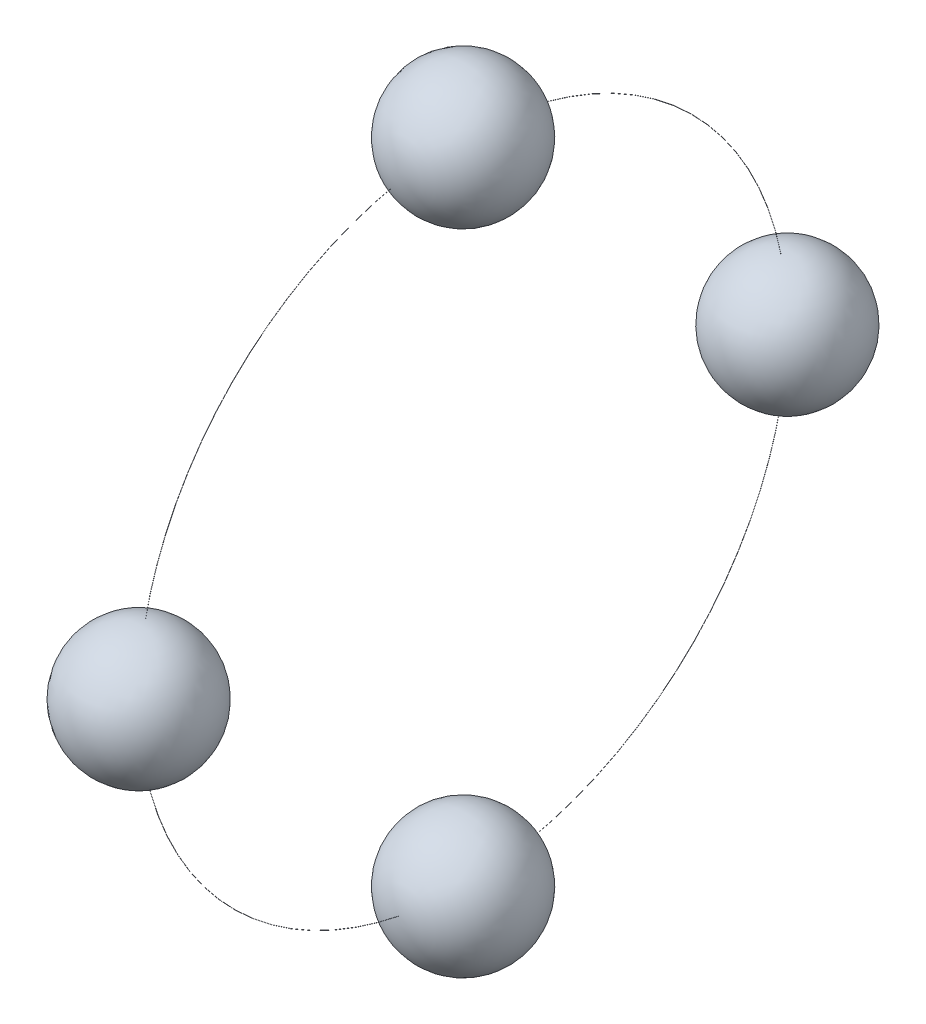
ISO-10303-21;
HEADER;
FILE_DESCRIPTION(('STEP AP214'),'2;1');
FILE_NAME('part.step','',(''),(''),'','','');
FILE_SCHEMA(('AUTOMOTIVE_DESIGN { 1 0 10303 214 1 1 1 1 }'));
ENDSEC;
DATA;
#1=APPLICATION_CONTEXT('core data for automotive mechanical design processes');
#2=APPLICATION_PROTOCOL_DEFINITION('international standard','automotive_design',2000,#1);
#3=PRODUCT_CONTEXT('',#1,'mechanical');
#4=PRODUCT('Part','Part','',(#3));
#5=PRODUCT_RELATED_PRODUCT_CATEGORY('part','',(#4));
#6=PRODUCT_DEFINITION_FORMATION('','',#4);
#7=PRODUCT_DEFINITION_CONTEXT('part definition',#1,'design');
#8=PRODUCT_DEFINITION('design','',#6,#7);
#9=PRODUCT_DEFINITION_SHAPE('','',#8);
#10=(LENGTH_UNIT() NAMED_UNIT(*) SI_UNIT(.MILLI.,.METRE.));
#11=(NAMED_UNIT(*) PLANE_ANGLE_UNIT() SI_UNIT($,.RADIAN.));
#12=(NAMED_UNIT(*) SI_UNIT($,.STERADIAN.) SOLID_ANGLE_UNIT());
#13=UNCERTAINTY_MEASURE_WITH_UNIT(LENGTH_MEASURE(1.E-05),#10,'distance_accuracy_value','');
#14=(GEOMETRIC_REPRESENTATION_CONTEXT(3) GLOBAL_UNCERTAINTY_ASSIGNED_CONTEXT((#13)) GLOBAL_UNIT_ASSIGNED_CONTEXT((#10,
#11,#12)) REPRESENTATION_CONTEXT('',''));
#15=CARTESIAN_POINT('',(0.,0.,0.));
#16=DIRECTION('',(0.,0.,1.));
#17=DIRECTION('',(1.,0.,0.));
#18=AXIS2_PLACEMENT_3D('',#15,#16,#17);
#19=CARTESIAN_POINT('',(3.,0.,0.));
#20=DIRECTION('',(1.,0.,0.));
#21=DIRECTION('',(0.,-1.,0.));
#22=AXIS2_PLACEMENT_3D('',#19,#20,#21);
#23=TOROIDAL_SURFACE('',#22,8.,0.002);
#24=CARTESIAN_POINT('',(2.99941404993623,-1.59217084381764,-7.84191249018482));
#25=CARTESIAN_POINT('',(2.99930675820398,-1.59216753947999,-7.84187960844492));
#26=CARTESIAN_POINT('',(2.9992021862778,-1.59216332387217,-7.84183765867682));
#27=CARTESIAN_POINT('',(2.99900153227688,-1.59215319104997,-7.84173682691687));
#28=CARTESIAN_POINT('',(2.99890546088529,-1.59214727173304,-7.84167792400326));
#29=CARTESIAN_POINT('',(2.99872466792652,-1.59213390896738,-7.84154495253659));
#30=CARTESIAN_POINT('',(2.9986399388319,-1.59212646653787,-7.84147089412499));
#31=CARTESIAN_POINT('',(2.99848415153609,-1.59211027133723,-7.84130973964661));
#32=CARTESIAN_POINT('',(2.99841309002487,-1.5921015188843,-7.84122264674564));
#33=CARTESIAN_POINT('',(2.99828634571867,-1.59208291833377,-7.84103756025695));
#34=CARTESIAN_POINT('',(2.99823071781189,-1.59207306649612,-7.84093952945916));
#35=CARTESIAN_POINT('',(2.99813670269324,-1.59205257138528,-7.84073559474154));
#36=CARTESIAN_POINT('',(2.99809831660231,-1.59204192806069,-7.84062969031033));
#37=CARTESIAN_POINT('',(2.99803970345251,-1.59202009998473,-7.84041249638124));
#38=CARTESIAN_POINT('',(2.99801956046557,-1.59200891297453,-7.84030118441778));
#39=CARTESIAN_POINT('',(2.99799828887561,-1.59198635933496,-7.84007677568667));
#40=CARTESIAN_POINT('',(2.99799716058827,-1.5919749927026,-7.83996367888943));
#41=CARTESIAN_POINT('',(2.99801397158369,-1.59195237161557,-7.83973860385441));
#42=CARTESIAN_POINT('',(2.9980319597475,-1.59194111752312,-7.83962662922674));
#43=CARTESIAN_POINT('',(2.99808658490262,-1.59191907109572,-7.83940727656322));
#44=CARTESIAN_POINT('',(2.99812322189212,-1.59190827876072,-7.83929989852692));
#45=CARTESIAN_POINT('',(2.99821410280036,-1.59188747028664,-7.83909286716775));
#46=CARTESIAN_POINT('',(2.99826833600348,-1.59187745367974,-7.83899320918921));
#47=CARTESIAN_POINT('',(2.99839290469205,-1.5918584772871,-7.83880440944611));
#48=CARTESIAN_POINT('',(2.9984632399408,-1.59184951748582,-7.83871526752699));
#49=CARTESIAN_POINT('',(2.9986177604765,-1.5918329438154,-7.83855037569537));
#50=CARTESIAN_POINT('',(2.99870189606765,-1.59182532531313,-7.83847457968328));
#51=CARTESIAN_POINT('',(2.99888181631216,-1.59181161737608,-7.83833820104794));
#52=CARTESIAN_POINT('',(2.99897760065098,-1.59180552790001,-7.83827761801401));
#53=CARTESIAN_POINT('',(2.99917759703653,-1.59179508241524,-7.8381736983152));
#54=CARTESIAN_POINT('',(2.99928176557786,-1.59179071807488,-7.83813027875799));
#55=CARTESIAN_POINT('',(2.99949596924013,-1.59178380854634,-7.83806153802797));
#56=CARTESIAN_POINT('',(2.99960600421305,-1.59178126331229,-7.83803621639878));
#57=CARTESIAN_POINT('',(2.99982833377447,-1.59177807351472,-7.83800448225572));
#58=CARTESIAN_POINT('',(2.9999406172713,-1.59177742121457,-7.83799799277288));
#59=CARTESIAN_POINT('',(3.00016468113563,-1.59177801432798,-7.83800389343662));
#60=CARTESIAN_POINT('',(3.00027646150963,-1.59177925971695,-7.83801628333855));
#61=CARTESIAN_POINT('',(3.0004961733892,-1.59178360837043,-7.83805954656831));
#62=CARTESIAN_POINT('',(3.00060411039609,-1.59178670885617,-7.83809039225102));
#63=CARTESIAN_POINT('',(3.00081326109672,-1.59179467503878,-7.83816964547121));
#64=CARTESIAN_POINT('',(3.00091447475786,-1.5917995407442,-7.83821805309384));
#65=CARTESIAN_POINT('',(3.00110750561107,-1.59181090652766,-7.83833112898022));
#66=CARTESIAN_POINT('',(3.00119930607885,-1.59181740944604,-7.83839582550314));
#67=CARTESIAN_POINT('',(3.00137074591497,-1.59183185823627,-7.83853957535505));
#68=CARTESIAN_POINT('',(3.00145038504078,-1.59183980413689,-7.83861862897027));
#69=CARTESIAN_POINT('',(3.00159560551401,-1.59185694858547,-7.83878920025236));
#70=CARTESIAN_POINT('',(3.00166112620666,-1.59186615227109,-7.83888076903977));
#71=CARTESIAN_POINT('',(3.0017758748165,-1.59188552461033,-7.83907350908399));
#72=CARTESIAN_POINT('',(3.00182510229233,-1.59189569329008,-7.83917468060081));
#73=CARTESIAN_POINT('',(3.00190611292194,-1.59191675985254,-7.83938428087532));
#74=CARTESIAN_POINT('',(3.00193781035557,-1.59192766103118,-7.83949274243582));
#75=CARTESIAN_POINT('',(3.00198252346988,-1.59194983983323,-7.83971341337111));
#76=CARTESIAN_POINT('',(3.00199553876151,-1.59196111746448,-7.83982562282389));
#77=CARTESIAN_POINT('',(3.00200254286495,-1.59198376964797,-7.84005100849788));
#78=CARTESIAN_POINT('',(3.00199646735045,-1.59199514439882,-7.8401641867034));
#79=CARTESIAN_POINT('',(3.00196531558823,-1.59201763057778,-7.84038792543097));
#80=CARTESIAN_POINT('',(3.0019402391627,-1.59202874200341,-7.84049848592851));
#81=CARTESIAN_POINT('',(3.00187176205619,-1.59205039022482,-7.84071389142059));
#82=CARTESIAN_POINT('',(3.00182835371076,-1.59206092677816,-7.84081873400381));
#83=CARTESIAN_POINT('',(3.00172441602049,-1.59208111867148,-7.84101965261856));
#84=CARTESIAN_POINT('',(3.00166388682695,-1.59209077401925,-7.84111572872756));
#85=CARTESIAN_POINT('',(3.00152758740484,-1.59210890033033,-7.84129609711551));
#86=CARTESIAN_POINT('',(3.00145185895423,-1.5921173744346,-7.84138042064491));
#87=CARTESIAN_POINT('',(3.00128719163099,-1.59213292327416,-7.84153514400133));
#88=CARTESIAN_POINT('',(3.00119825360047,-1.59213999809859,-7.84160554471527));
#89=CARTESIAN_POINT('',(3.00101014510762,-1.59215251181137,-7.84173006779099));
#90=CARTESIAN_POINT('',(3.0009110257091,-1.59215795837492,-7.84178426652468));
#91=CARTESIAN_POINT('',(3.00070498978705,-1.59216710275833,-7.84187526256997));
#92=CARTESIAN_POINT('',(3.00059807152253,-1.59217080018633,-7.84191205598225));
#93=CARTESIAN_POINT('',(3.00037998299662,-1.59217632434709,-7.84196702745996));
#94=CARTESIAN_POINT('',(3.00026883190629,-1.59217815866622,-7.84198528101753));
#95=CARTESIAN_POINT('',(3.00004512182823,-1.5921799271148,-7.84200287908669));
#96=CARTESIAN_POINT('',(2.99993256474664,-1.59217986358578,-7.84200224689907));
#97=CARTESIAN_POINT('',(2.99975196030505,-1.59217823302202,-7.8419860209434));
#98=CARTESIAN_POINT('',(2.99968333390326,-1.59217724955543,-7.84197623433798));
#99=CARTESIAN_POINT('',(2.99954747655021,-1.59217457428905,-7.84194961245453));
#100=CARTESIAN_POINT('',(2.99948024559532,-1.59217288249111,-7.84193277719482));
#101=CARTESIAN_POINT('',(2.99941404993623,-1.59217084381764,-7.84191249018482));
#102=B_SPLINE_CURVE_WITH_KNOTS('',3,(#24,#25,#26,#27,#28,#29,#30,#31,#32,#33,#34,#35,#36,#37,
#38,#39,#40,#41,#42,#43,#44,#45,#46,#47,#48,#49,#50,#51,#52,#53,#54,#55,#56,#57,#58,#59,#60,#61,
#62,#63,#64,#65,#66,#67,#68,#69,#70,#71,#72,#73,#74,#75,#76,#77,#78,#79,#80,#81,#82,#83,#84,#85,
#86,#87,#88,#89,#90,#91,#92,#93,#94,#95,#96,#97,#98,#99,#100,#101),.UNSPECIFIED.,.T.,.F.,(4,2,2,
2,2,2,2,2,2,2,2,2,2,2,2,2,2,2,2,2,2,2,2,2,2,2,2,2,2,2,2,2,2,2,2,2,2,2,4),(0.,
0.000336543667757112,0.000673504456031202,0.00101024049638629,0.0013468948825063,
0.00168473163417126,0.00202259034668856,0.0023619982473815,0.0027014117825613,
0.00304169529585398,0.00338197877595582,0.00372205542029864,0.00406212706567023,
0.00440099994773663,0.00473986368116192,0.00507707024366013,0.00541426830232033,
0.00575008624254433,0.00608589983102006,0.00642121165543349,0.00675652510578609,
0.00709242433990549,0.00742833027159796,0.00776565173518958,0.00810298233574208,
0.00844194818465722,0.00878092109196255,0.00912103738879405,0.00946115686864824,
0.00980141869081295,0.0101416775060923,0.0104810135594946,0.0108203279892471,0.0111580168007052,
0.0114957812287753,0.011832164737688,0.0121681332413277,0.012375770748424,0.0125834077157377),.UNSPECIFIED.);
#103=CARTESIAN_POINT('',(2.99941404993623,-1.59217084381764,-7.84191249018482));
#104=VERTEX_POINT('',#103);
#105=EDGE_CURVE('E10',#104,#104,#102,.T.);
#106=ORIENTED_EDGE('',*,*,#105,.F.);
#107=EDGE_LOOP('',(#106));
#108=FACE_BOUND('',#107,.T.);
#109=CARTESIAN_POINT('',(2.99941404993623,-7.84191249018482,-1.59217084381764));
#110=CARTESIAN_POINT('',(2.99952091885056,-7.84194523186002,-1.59217413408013));
#111=CARTESIAN_POINT('',(2.99963064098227,-7.84196902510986,-1.59217652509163));
#112=CARTESIAN_POINT('',(2.99985263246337,-7.84199795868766,-1.59217943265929));
#113=CARTESIAN_POINT('',(2.99996490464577,-7.84200307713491,-1.59217994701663));
#114=CARTESIAN_POINT('',(3.00018867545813,-7.84199447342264,-1.59217908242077));
#115=CARTESIAN_POINT('',(3.00030017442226,-7.84198075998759,-1.5921777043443));
#116=CARTESIAN_POINT('',(3.00051924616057,-7.84193490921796,-1.59217309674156));
#117=CARTESIAN_POINT('',(3.00062681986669,-7.84190277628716,-1.59216986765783));
#118=CARTESIAN_POINT('',(3.00083507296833,-7.84182101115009,-1.59216165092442));
#119=CARTESIAN_POINT('',(3.00093574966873,-7.84177137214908,-1.59215666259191));
#120=CARTESIAN_POINT('',(3.00112733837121,-7.84165603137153,-1.59214507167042));
#121=CARTESIAN_POINT('',(3.00121824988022,-7.84159032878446,-1.59213846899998));
#122=CARTESIAN_POINT('',(3.00138804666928,-7.84144451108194,-1.59212381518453));
#123=CARTESIAN_POINT('',(3.00146689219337,-7.84136435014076,-1.59211575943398));
#124=CARTESIAN_POINT('',(3.0016100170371,-7.84119205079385,-1.59209844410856));
#125=CARTESIAN_POINT('',(3.00167429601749,-7.84109991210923,-1.59208918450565));
#126=CARTESIAN_POINT('',(3.00178679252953,-7.84090579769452,-1.59206967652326));
#127=CARTESIAN_POINT('',(3.00183493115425,-7.84080377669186,-1.59205942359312));
#128=CARTESIAN_POINT('',(3.00191339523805,-7.84059316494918,-1.59203825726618));
#129=CARTESIAN_POINT('',(3.00194372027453,-7.84048457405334,-1.59202734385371));
#130=CARTESIAN_POINT('',(3.0019858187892,-7.8402634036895,-1.59200511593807));
#131=CARTESIAN_POINT('',(3.00199751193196,-7.84015080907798,-1.59199379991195));
#132=CARTESIAN_POINT('',(3.00200177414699,-7.83992526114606,-1.59197113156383));
#133=CARTESIAN_POINT('',(3.00199434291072,-7.83981230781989,-1.59195977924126));
#134=CARTESIAN_POINT('',(3.00196052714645,-7.83958902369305,-1.59193733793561));
#135=CARTESIAN_POINT('',(3.00193410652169,-7.83947869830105,-1.59192624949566));
#136=CARTESIAN_POINT('',(3.00186300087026,-7.839264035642,-1.59190467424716));
#137=CARTESIAN_POINT('',(3.00181831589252,-7.83915969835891,-1.59189418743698));
#138=CARTESIAN_POINT('',(3.00171199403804,-7.83896013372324,-1.59187412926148));
#139=CARTESIAN_POINT('',(3.00165037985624,-7.83886489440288,-1.59186455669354));
#140=CARTESIAN_POINT('',(3.00151189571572,-7.83868611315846,-1.59184658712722));
#141=CARTESIAN_POINT('',(3.001435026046,-7.83860257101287,-1.59183819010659));
#142=CARTESIAN_POINT('',(3.00126853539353,-7.83844992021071,-1.59182284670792));
#143=CARTESIAN_POINT('',(3.00117896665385,-7.83838075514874,-1.59181589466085));
#144=CARTESIAN_POINT('',(3.0009893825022,-7.83825845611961,-1.59180360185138));
#145=CARTESIAN_POINT('',(3.0008893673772,-7.83820532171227,-1.59179826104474));
#146=CARTESIAN_POINT('',(3.00068225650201,-7.83811686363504,-1.59178936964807));
#147=CARTESIAN_POINT('',(3.00057519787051,-7.83808145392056,-1.59178581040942));
#148=CARTESIAN_POINT('',(3.00035661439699,-7.83802909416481,-1.59178054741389));
#149=CARTESIAN_POINT('',(3.00024508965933,-7.8380121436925,-1.59177884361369));
#150=CARTESIAN_POINT('',(3.00002117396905,-7.83799722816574,-1.59177734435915));
#151=CARTESIAN_POINT('',(2.9999087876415,-7.83799919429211,-1.59177754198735));
#152=CARTESIAN_POINT('',(2.99968594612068,-7.83802188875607,-1.59177982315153));
#153=CARTESIAN_POINT('',(2.99957549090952,-7.83804261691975,-1.59178190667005));
#154=CARTESIAN_POINT('',(2.99935973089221,-7.83810220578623,-1.59178789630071));
#155=CARTESIAN_POINT('',(2.99925442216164,-7.83814105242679,-1.59179180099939));
#156=CARTESIAN_POINT('',(2.99905183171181,-7.83823574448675,-1.59180131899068));
#157=CARTESIAN_POINT('',(2.99895455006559,-7.83829159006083,-1.59180693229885));
#158=CARTESIAN_POINT('',(2.9987705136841,-7.83841882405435,-1.59181972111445));
#159=CARTESIAN_POINT('',(2.99868378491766,-7.83849024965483,-1.59182690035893));
#160=CARTESIAN_POINT('',(2.9985235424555,-7.83864651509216,-1.59184260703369));
#161=CARTESIAN_POINT('',(2.99845002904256,-7.83873135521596,-1.59185113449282));
#162=CARTESIAN_POINT('',(2.99831794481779,-7.83891245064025,-1.59186933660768));
#163=CARTESIAN_POINT('',(2.99825944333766,-7.83900875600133,-1.59187901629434));
#164=CARTESIAN_POINT('',(2.99815943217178,-7.83920973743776,-1.59189921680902));
#165=CARTESIAN_POINT('',(2.99811792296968,-7.83931441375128,-1.59190973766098));
#166=CARTESIAN_POINT('',(2.998052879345,-7.83952969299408,-1.591931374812));
#167=CARTESIAN_POINT('',(2.99802943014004,-7.83964032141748,-1.59194249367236));
#168=CARTESIAN_POINT('',(2.99800147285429,-7.83986392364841,-1.59196496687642));
#169=CARTESIAN_POINT('',(2.99799696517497,-7.83997689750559,-1.59197632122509));
#170=CARTESIAN_POINT('',(2.99800702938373,-7.84020232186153,-1.59199897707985));
#171=CARTESIAN_POINT('',(2.9980216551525,-7.84031476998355,-1.59201027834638));
#172=CARTESIAN_POINT('',(2.99806967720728,-7.84053562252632,-1.59203247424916));
#173=CARTESIAN_POINT('',(2.99810307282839,-7.84064402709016,-1.5920433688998));
#174=CARTESIAN_POINT('',(2.99818769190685,-7.84085366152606,-1.59206443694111));
#175=CARTESIAN_POINT('',(2.99823890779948,-7.84095489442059,-1.59207461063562));
#176=CARTESIAN_POINT('',(2.9983577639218,-7.84114735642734,-1.59209395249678));
#177=CARTESIAN_POINT('',(2.99842540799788,-7.84123858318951,-1.5921031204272));
#178=CARTESIAN_POINT('',(2.99857498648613,-7.84140811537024,-1.59212015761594));
#179=CARTESIAN_POINT('',(2.99865687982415,-7.84148645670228,-1.59212803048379));
#180=CARTESIAN_POINT('',(2.99883272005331,-7.84162818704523,-1.59214227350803));
#181=CARTESIAN_POINT('',(2.99892665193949,-7.84169159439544,-1.59214864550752));
#182=CARTESIAN_POINT('',(2.99908684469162,-7.84178102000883,-1.59215763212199));
#183=CARTESIAN_POINT('',(2.99915028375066,-7.84181214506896,-1.59216075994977));
#184=CARTESIAN_POINT('',(2.99928011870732,-7.84186753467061,-1.59216632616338));
#185=CARTESIAN_POINT('',(2.99934651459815,-7.84189179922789,-1.5921687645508));
#186=CARTESIAN_POINT('',(2.99941404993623,-7.84191249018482,-1.59217084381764));
#187=B_SPLINE_CURVE_WITH_KNOTS('',3,(#109,#110,#111,#112,#113,#114,#115,#116,#117,#118,#119,
#120,#121,#122,#123,#124,#125,#126,#127,#128,#129,#130,#131,#132,#133,#134,#135,#136,#137,#138,
#139,#140,#141,#142,#143,#144,#145,#146,#147,#148,#149,#150,#151,#152,#153,#154,#155,#156,#157,
#158,#159,#160,#161,#162,#163,#164,#165,#166,#167,#168,#169,#170,#171,#172,#173,#174,#175,#176,
#177,#178,#179,#180,#181,#182,#183,#184,#185,#186),.UNSPECIFIED.,.T.,.F.,(4,2,2,2,2,2,2,2,2,2,2,
2,2,2,2,2,2,2,2,2,2,2,2,2,2,2,2,2,2,2,2,2,2,2,2,2,2,2,4),(0.,0.000335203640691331,
0.000670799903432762,0.00100624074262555,0.00134160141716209,0.00167709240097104,
0.00201260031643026,0.0023491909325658,0.00268578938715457,0.00302401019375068,
0.00336223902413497,0.00370192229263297,0.00404161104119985,0.00438194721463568,
0.00472228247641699,0.0050621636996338,0.00540203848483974,0.00574055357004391,
0.00607905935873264,0.00641590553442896,0.00675274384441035,0.00708835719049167,
0.00742396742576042,0.00775931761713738,0.00809467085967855,0.00843083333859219,
0.0087670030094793,0.00910469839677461,0.0094424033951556,0.00978169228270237,
0.0101209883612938,0.0104612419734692,0.010801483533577,0.0111415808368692,0.0114817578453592,
0.0118209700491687,0.0121597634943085,0.012371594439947,0.0125834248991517),.UNSPECIFIED.);
#188=CARTESIAN_POINT('',(2.99941404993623,-7.84191249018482,-1.59217084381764));
#189=VERTEX_POINT('',#188);
#190=EDGE_CURVE('E37',#189,#189,#187,.T.);
#191=ORIENTED_EDGE('',*,*,#190,.F.);
#192=EDGE_LOOP('',(#191));
#193=FACE_BOUND('',#192,.T.);
#194=ADVANCED_FACE('F15',(#108,#193),#23,.T.);
#195=CARTESIAN_POINT('',(2.99941404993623,1.59217084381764,-7.84191249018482));
#196=CARTESIAN_POINT('',(2.99952091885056,1.59217413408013,-7.84194523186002));
#197=CARTESIAN_POINT('',(2.99963064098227,1.59217652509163,-7.84196902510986));
#198=CARTESIAN_POINT('',(2.99985263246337,1.59217943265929,-7.84199795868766));
#199=CARTESIAN_POINT('',(2.99996490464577,1.59217994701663,-7.84200307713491));
#200=CARTESIAN_POINT('',(3.00018867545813,1.59217908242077,-7.84199447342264));
#201=CARTESIAN_POINT('',(3.00030017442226,1.5921777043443,-7.84198075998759));
#202=CARTESIAN_POINT('',(3.00051924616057,1.59217309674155,-7.84193490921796));
#203=CARTESIAN_POINT('',(3.00062681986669,1.59216986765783,-7.84190277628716));
#204=CARTESIAN_POINT('',(3.00083507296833,1.59216165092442,-7.84182101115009));
#205=CARTESIAN_POINT('',(3.00093574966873,1.59215666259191,-7.84177137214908));
#206=CARTESIAN_POINT('',(3.00112733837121,1.59214507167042,-7.84165603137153));
#207=CARTESIAN_POINT('',(3.00121824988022,1.59213846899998,-7.84159032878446));
#208=CARTESIAN_POINT('',(3.00138804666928,1.59212381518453,-7.84144451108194));
#209=CARTESIAN_POINT('',(3.00146689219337,1.59211575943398,-7.84136435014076));
#210=CARTESIAN_POINT('',(3.0016100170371,1.59209844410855,-7.84119205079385));
#211=CARTESIAN_POINT('',(3.00167429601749,1.59208918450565,-7.84109991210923));
#212=CARTESIAN_POINT('',(3.00178679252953,1.59206967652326,-7.84090579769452));
#213=CARTESIAN_POINT('',(3.00183493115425,1.59205942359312,-7.84080377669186));
#214=CARTESIAN_POINT('',(3.00191339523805,1.59203825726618,-7.84059316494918));
#215=CARTESIAN_POINT('',(3.00194372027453,1.59202734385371,-7.84048457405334));
#216=CARTESIAN_POINT('',(3.0019858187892,1.59200511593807,-7.8402634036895));
#217=CARTESIAN_POINT('',(3.00199751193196,1.59199379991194,-7.84015080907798));
#218=CARTESIAN_POINT('',(3.00200177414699,1.59197113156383,-7.83992526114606));
#219=CARTESIAN_POINT('',(3.00199434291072,1.59195977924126,-7.83981230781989));
#220=CARTESIAN_POINT('',(3.00196052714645,1.59193733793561,-7.83958902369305));
#221=CARTESIAN_POINT('',(3.00193410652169,1.59192624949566,-7.83947869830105));
#222=CARTESIAN_POINT('',(3.00186300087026,1.59190467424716,-7.839264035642));
#223=CARTESIAN_POINT('',(3.00181831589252,1.59189418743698,-7.83915969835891));
#224=CARTESIAN_POINT('',(3.00171199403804,1.59187412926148,-7.83896013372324));
#225=CARTESIAN_POINT('',(3.00165037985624,1.59186455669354,-7.83886489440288));
#226=CARTESIAN_POINT('',(3.00151189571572,1.59184658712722,-7.83868611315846));
#227=CARTESIAN_POINT('',(3.001435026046,1.59183819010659,-7.83860257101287));
#228=CARTESIAN_POINT('',(3.00126853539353,1.59182284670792,-7.83844992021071));
#229=CARTESIAN_POINT('',(3.00117896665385,1.59181589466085,-7.83838075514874));
#230=CARTESIAN_POINT('',(3.0009893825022,1.59180360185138,-7.83825845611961));
#231=CARTESIAN_POINT('',(3.0008893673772,1.59179826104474,-7.83820532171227));
#232=CARTESIAN_POINT('',(3.00068225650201,1.59178936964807,-7.83811686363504));
#233=CARTESIAN_POINT('',(3.00057519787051,1.59178581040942,-7.83808145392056));
#234=CARTESIAN_POINT('',(3.00035661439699,1.59178054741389,-7.83802909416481));
#235=CARTESIAN_POINT('',(3.00024508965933,1.59177884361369,-7.8380121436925));
#236=CARTESIAN_POINT('',(3.00002117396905,1.59177734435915,-7.83799722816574));
#237=CARTESIAN_POINT('',(2.9999087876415,1.59177754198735,-7.83799919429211));
#238=CARTESIAN_POINT('',(2.99968594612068,1.59177982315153,-7.83802188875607));
#239=CARTESIAN_POINT('',(2.99957549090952,1.59178190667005,-7.83804261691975));
#240=CARTESIAN_POINT('',(2.99935973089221,1.59178789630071,-7.83810220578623));
#241=CARTESIAN_POINT('',(2.99925442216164,1.59179180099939,-7.83814105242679));
#242=CARTESIAN_POINT('',(2.99905183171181,1.59180131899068,-7.83823574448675));
#243=CARTESIAN_POINT('',(2.99895455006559,1.59180693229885,-7.83829159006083));
#244=CARTESIAN_POINT('',(2.9987705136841,1.59181972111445,-7.83841882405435));
#245=CARTESIAN_POINT('',(2.99868378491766,1.59182690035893,-7.83849024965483));
#246=CARTESIAN_POINT('',(2.9985235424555,1.59184260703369,-7.83864651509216));
#247=CARTESIAN_POINT('',(2.99845002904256,1.59185113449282,-7.83873135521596));
#248=CARTESIAN_POINT('',(2.99831794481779,1.59186933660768,-7.83891245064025));
#249=CARTESIAN_POINT('',(2.99825944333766,1.59187901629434,-7.83900875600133));
#250=CARTESIAN_POINT('',(2.99815943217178,1.59189921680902,-7.83920973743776));
#251=CARTESIAN_POINT('',(2.99811792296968,1.59190973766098,-7.83931441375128));
#252=CARTESIAN_POINT('',(2.998052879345,1.591931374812,-7.83952969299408));
#253=CARTESIAN_POINT('',(2.99802943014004,1.59194249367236,-7.83964032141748));
#254=CARTESIAN_POINT('',(2.99800147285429,1.59196496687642,-7.83986392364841));
#255=CARTESIAN_POINT('',(2.99799696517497,1.59197632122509,-7.83997689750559));
#256=CARTESIAN_POINT('',(2.99800702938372,1.59199897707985,-7.84020232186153));
#257=CARTESIAN_POINT('',(2.9980216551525,1.59201027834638,-7.84031476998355));
#258=CARTESIAN_POINT('',(2.99806967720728,1.59203247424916,-7.84053562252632));
#259=CARTESIAN_POINT('',(2.99810307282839,1.59204336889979,-7.84064402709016));
#260=CARTESIAN_POINT('',(2.99818769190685,1.5920644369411,-7.84085366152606));
#261=CARTESIAN_POINT('',(2.99823890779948,1.59207461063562,-7.84095489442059));
#262=CARTESIAN_POINT('',(2.9983577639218,1.59209395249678,-7.84114735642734));
#263=CARTESIAN_POINT('',(2.99842540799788,1.5921031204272,-7.84123858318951));
#264=CARTESIAN_POINT('',(2.99857498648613,1.59212015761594,-7.84140811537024));
#265=CARTESIAN_POINT('',(2.99865687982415,1.59212803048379,-7.84148645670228));
#266=CARTESIAN_POINT('',(2.99883272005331,1.59214227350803,-7.84162818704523));
#267=CARTESIAN_POINT('',(2.99892665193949,1.59214864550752,-7.84169159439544));
#268=CARTESIAN_POINT('',(2.99908684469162,1.59215763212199,-7.84178102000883));
#269=CARTESIAN_POINT('',(2.99915028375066,1.59216075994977,-7.84181214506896));
#270=CARTESIAN_POINT('',(2.99928011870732,1.59216632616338,-7.84186753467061));
#271=CARTESIAN_POINT('',(2.99934651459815,1.5921687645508,-7.84189179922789));
#272=CARTESIAN_POINT('',(2.99941404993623,1.59217084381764,-7.84191249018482));
#273=B_SPLINE_CURVE_WITH_KNOTS('',3,(#195,#196,#197,#198,#199,#200,#201,#202,#203,#204,#205,
#206,#207,#208,#209,#210,#211,#212,#213,#214,#215,#216,#217,#218,#219,#220,#221,#222,#223,#224,
#225,#226,#227,#228,#229,#230,#231,#232,#233,#234,#235,#236,#237,#238,#239,#240,#241,#242,#243,
#244,#245,#246,#247,#248,#249,#250,#251,#252,#253,#254,#255,#256,#257,#258,#259,#260,#261,#262,
#263,#264,#265,#266,#267,#268,#269,#270,#271,#272),.UNSPECIFIED.,.T.,.F.,(4,2,2,2,2,2,2,2,2,2,2,
2,2,2,2,2,2,2,2,2,2,2,2,2,2,2,2,2,2,2,2,2,2,2,2,2,2,2,4),(0.,0.000335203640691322,
0.000670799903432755,0.00100624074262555,0.00134160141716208,0.00167709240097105,
0.00201260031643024,0.00234919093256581,0.00268578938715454,0.0030240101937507,
0.00336223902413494,0.00370192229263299,0.00404161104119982,0.00438194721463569,
0.00472228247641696,0.00506216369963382,0.00540203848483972,0.00574055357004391,
0.00607905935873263,0.00641590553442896,0.00675274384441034,0.00708835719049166,
0.00742396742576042,0.00775931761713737,0.00809467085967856,0.00843083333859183,
0.00876700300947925,0.00910469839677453,0.00944240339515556,0.00978169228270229,
0.0101209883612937,0.0104612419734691,0.0108014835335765,0.011141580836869,0.0114817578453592,
0.0118209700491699,0.0121597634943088,0.0123715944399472,0.012583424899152),.UNSPECIFIED.);
#274=CARTESIAN_POINT('',(2.99941404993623,1.59217084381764,-7.84191249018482));
#275=VERTEX_POINT('',#274);
#276=EDGE_CURVE('E28',#275,#275,#273,.T.);
#277=ORIENTED_EDGE('',*,*,#276,.F.);
#278=EDGE_LOOP('',(#277));
#279=FACE_BOUND('',#278,.T.);
#280=CARTESIAN_POINT('',(2.99938275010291,7.83809787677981,-1.59178745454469));
#281=CARTESIAN_POINT('',(2.99948906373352,7.83806338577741,-1.59178398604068));
#282=CARTESIAN_POINT('',(2.99959838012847,7.83803780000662,-1.59178142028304));
#283=CARTESIAN_POINT('',(2.99981986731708,7.83800523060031,-1.59177815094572));
#284=CARTESIAN_POINT('',(2.99993204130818,7.83799826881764,-1.59177744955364));
#285=CARTESIAN_POINT('',(3.00015592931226,7.83800319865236,-1.59177794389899));
#286=CARTESIAN_POINT('',(3.00026764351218,7.83801508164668,-1.59177913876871));
#287=CARTESIAN_POINT('',(3.00048745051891,7.83805733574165,-1.59178338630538));
#288=CARTESIAN_POINT('',(3.00059554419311,7.83808770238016,-1.59178643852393));
#289=CARTESIAN_POINT('',(3.00080511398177,7.83816604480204,-1.59179431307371));
#290=CARTESIAN_POINT('',(3.00090658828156,7.83821402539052,-1.59179913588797));
#291=CARTESIAN_POINT('',(3.00110003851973,7.83832620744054,-1.5918104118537));
#292=CARTESIAN_POINT('',(3.00119201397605,7.83839040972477,-1.59181686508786));
#293=CARTESIAN_POINT('',(3.00136416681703,7.83853341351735,-1.59183123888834));
#294=CARTESIAN_POINT('',(3.0014443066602,7.83861225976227,-1.59183916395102));
#295=CARTESIAN_POINT('',(3.00159022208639,7.83878216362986,-1.59185624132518));
#296=CARTESIAN_POINT('',(3.00165599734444,7.83887322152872,-1.59186539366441));
#297=CARTESIAN_POINT('',(3.00177165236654,7.83906543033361,-1.59188471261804));
#298=CARTESIAN_POINT('',(3.00182145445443,7.8391666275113,-1.59189488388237));
#299=CARTESIAN_POINT('',(3.00190336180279,7.83937587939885,-1.59191591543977));
#300=CARTESIAN_POINT('',(3.00193546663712,7.83948393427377,-1.59192677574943));
#301=CARTESIAN_POINT('',(3.00198120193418,7.83970434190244,-1.59194892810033));
#302=CARTESIAN_POINT('',(3.00199475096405,7.83981671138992,-1.59196022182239));
#303=CARTESIAN_POINT('',(3.00200273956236,7.84004212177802,-1.59198287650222));
#304=CARTESIAN_POINT('',(3.00199717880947,7.8401551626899,-1.59199423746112));
#305=CARTESIAN_POINT('',(3.00196706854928,7.84037895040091,-1.59201672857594));
#306=CARTESIAN_POINT('',(3.00194248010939,7.84048969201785,-1.59202785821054));
#307=CARTESIAN_POINT('',(3.00187494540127,7.84070548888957,-1.59204954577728));
#308=CARTESIAN_POINT('',(3.00183199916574,7.84081054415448,-1.59206010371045));
#309=CARTESIAN_POINT('',(3.00172900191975,7.84101184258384,-1.59208033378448));
#310=CARTESIAN_POINT('',(3.00166897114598,7.84110809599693,-1.59209000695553));
#311=CARTESIAN_POINT('',(3.00153346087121,7.841289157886,-1.59210820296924));
#312=CARTESIAN_POINT('',(3.00145798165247,7.84137396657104,-1.5921167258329));
#313=CARTESIAN_POINT('',(3.00129402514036,7.84152936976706,-1.59213234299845));
#314=CARTESIAN_POINT('',(3.00120559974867,7.84160001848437,-1.59213944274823));
#315=CARTESIAN_POINT('',(3.00101803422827,7.84172545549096,-1.59215204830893));
#316=CARTESIAN_POINT('',(3.00091889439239,7.84178024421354,-1.5921575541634));
#317=CARTESIAN_POINT('',(3.00071323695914,7.84187212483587,-1.59216678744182));
#318=CARTESIAN_POINT('',(3.00060675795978,7.84190930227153,-1.59217052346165));
#319=CARTESIAN_POINT('',(3.00038902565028,7.84196526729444,-1.59217614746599));
#320=CARTESIAN_POINT('',(3.00027777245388,7.84198405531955,-1.59217803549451));
#321=CARTESIAN_POINT('',(3.00005409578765,7.84200265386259,-1.59217990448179));
#322=CARTESIAN_POINT('',(2.99994167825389,7.84200253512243,-1.59217989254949));
#323=CARTESIAN_POINT('',(2.99971846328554,7.84198350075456,-1.59217797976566));
#324=CARTESIAN_POINT('',(2.99960766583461,7.84196458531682,-1.59217607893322));
#325=CARTESIAN_POINT('',(2.99939093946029,7.84190853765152,-1.59217044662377));
#326=CARTESIAN_POINT('',(2.99928500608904,7.84187142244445,-1.59216671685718));
#327=CARTESIAN_POINT('',(2.99908088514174,7.84178006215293,-1.59215753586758));
#328=CARTESIAN_POINT('',(2.99898269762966,7.84172581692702,-1.59215208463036));
#329=CARTESIAN_POINT('',(2.99879660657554,7.84160162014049,-1.59213960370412));
#330=CARTESIAN_POINT('',(2.9987087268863,7.84153163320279,-1.59213257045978));
#331=CARTESIAN_POINT('',(2.9985459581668,7.84137803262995,-1.59211713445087));
#332=CARTESIAN_POINT('',(2.99847106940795,7.84129441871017,-1.5921087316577));
#333=CARTESIAN_POINT('',(2.9983360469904,7.8411155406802,-1.59209075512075));
#334=CARTESIAN_POINT('',(2.99827598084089,7.84102022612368,-1.59208117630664));
#335=CARTESIAN_POINT('',(2.99817269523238,7.84082095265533,-1.59206114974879));
#336=CARTESIAN_POINT('',(2.99812947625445,7.84071699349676,-1.59205070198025));
#337=CARTESIAN_POINT('',(2.99806090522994,7.84050285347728,-1.59202918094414));
#338=CARTESIAN_POINT('',(2.99803563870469,7.84039264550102,-1.59201810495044));
#339=CARTESIAN_POINT('',(2.99800399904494,7.84016957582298,-1.59199568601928));
#340=CARTESIAN_POINT('',(2.99799762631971,7.84005671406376,-1.59198434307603));
#341=CARTESIAN_POINT('',(2.99800395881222,7.83983118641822,-1.59196167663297));
#342=CARTESIAN_POINT('',(2.99801672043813,7.8397185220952,-1.59195035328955));
#343=CARTESIAN_POINT('',(2.99806107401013,7.83949692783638,-1.59192808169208));
#344=CARTESIAN_POINT('',(2.99809266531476,7.83938799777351,-1.59191713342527));
#345=CARTESIAN_POINT('',(2.99817379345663,7.83917699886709,-1.59189592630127));
#346=CARTESIAN_POINT('',(2.99822332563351,7.83907492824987,-1.59188566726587));
#347=CARTESIAN_POINT('',(2.99833897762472,7.83888051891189,-1.59186612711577));
#348=CARTESIAN_POINT('',(2.99840510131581,7.83878818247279,-1.59185684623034));
#349=CARTESIAN_POINT('',(2.99855186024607,7.83861618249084,-1.59183955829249));
#350=CARTESIAN_POINT('',(2.9986324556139,7.83853648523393,-1.59183154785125));
#351=CARTESIAN_POINT('',(2.99880594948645,7.83839184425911,-1.59181700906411));
#352=CARTESIAN_POINT('',(2.99889883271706,7.83832688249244,-1.5918104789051));
#353=CARTESIAN_POINT('',(2.99905757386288,7.83823479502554,-1.59180122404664));
#354=CARTESIAN_POINT('',(2.99912052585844,7.83820261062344,-1.59179799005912));
#355=CARTESIAN_POINT('',(2.99924950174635,7.83814505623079,-1.59179220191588));
#356=CARTESIAN_POINT('',(2.99931552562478,7.83811968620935,-1.59178964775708));
#357=CARTESIAN_POINT('',(2.99938275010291,7.83809787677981,-1.59178745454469));
#358=B_SPLINE_CURVE_WITH_KNOTS('',3,(#280,#281,#282,#283,#284,#285,#286,#287,#288,#289,#290,
#291,#292,#293,#294,#295,#296,#297,#298,#299,#300,#301,#302,#303,#304,#305,#306,#307,#308,#309,
#310,#311,#312,#313,#314,#315,#316,#317,#318,#319,#320,#321,#322,#323,#324,#325,#326,#327,#328,
#329,#330,#331,#332,#333,#334,#335,#336,#337,#338,#339,#340,#341,#342,#343,#344,#345,#346,#347,
#348,#349,#350,#351,#352,#353,#354,#355,#356,#357),.UNSPECIFIED.,.T.,.F.,(4,2,2,2,2,2,2,2,2,2,2,
2,2,2,2,2,2,2,2,2,2,2,2,2,2,2,2,2,2,2,2,2,2,2,2,2,2,2,4),(0.,0.000335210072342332,
0.000670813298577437,0.00100626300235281,0.00134163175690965,0.00167709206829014,
0.00201256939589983,0.00234908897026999,0.00268561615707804,0.00302375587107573,
0.00336190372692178,0.0037015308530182,0.00404116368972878,0.00438149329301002,
0.00472182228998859,0.00506174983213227,0.00540167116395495,0.00574026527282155,
0.00607885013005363,0.00641577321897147,0.00675268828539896,0.00708834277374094,
0.0074239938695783,0.00775933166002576,0.00809467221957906,0.00843077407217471,
0.00876688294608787,0.00910449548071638,0.00944211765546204,0.00978133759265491,
0.0101205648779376,0.0104607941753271,0.010801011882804,0.0111411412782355,0.0114813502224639,
0.0118206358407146,0.0121595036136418,0.0123714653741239,0.0125834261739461),.UNSPECIFIED.);
#359=CARTESIAN_POINT('',(2.99938275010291,7.83809787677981,-1.59178745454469));
#360=VERTEX_POINT('',#359);
#361=EDGE_CURVE('E86',#360,#360,#358,.T.);
#362=ORIENTED_EDGE('',*,*,#361,.F.);
#363=EDGE_LOOP('',(#362));
#364=FACE_BOUND('',#363,.T.);
#365=ADVANCED_FACE('F111',(#279,#364),#23,.T.);
#366=CARTESIAN_POINT('',(2.99941404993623,-7.84191249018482,1.59217084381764));
#367=CARTESIAN_POINT('',(2.99930675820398,-7.84187960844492,1.59216753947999));
#368=CARTESIAN_POINT('',(2.9992021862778,-7.84183765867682,1.59216332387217));
#369=CARTESIAN_POINT('',(2.99900153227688,-7.84173682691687,1.59215319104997));
#370=CARTESIAN_POINT('',(2.99890546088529,-7.84167792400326,1.59214727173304));
#371=CARTESIAN_POINT('',(2.99872466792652,-7.84154495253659,1.59213390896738));
#372=CARTESIAN_POINT('',(2.9986399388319,-7.84147089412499,1.59212646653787));
#373=CARTESIAN_POINT('',(2.99848415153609,-7.84130973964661,1.59211027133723));
#374=CARTESIAN_POINT('',(2.99841309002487,-7.84122264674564,1.5921015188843));
#375=CARTESIAN_POINT('',(2.99828634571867,-7.84103756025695,1.59208291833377));
#376=CARTESIAN_POINT('',(2.99823071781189,-7.84093952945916,1.59207306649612));
#377=CARTESIAN_POINT('',(2.99813670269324,-7.84073559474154,1.59205257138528));
#378=CARTESIAN_POINT('',(2.99809831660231,-7.84062969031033,1.59204192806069));
#379=CARTESIAN_POINT('',(2.99803970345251,-7.84041249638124,1.59202009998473));
#380=CARTESIAN_POINT('',(2.99801956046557,-7.84030118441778,1.59200891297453));
#381=CARTESIAN_POINT('',(2.99799828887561,-7.84007677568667,1.59198635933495));
#382=CARTESIAN_POINT('',(2.99799716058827,-7.83996367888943,1.59197499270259));
#383=CARTESIAN_POINT('',(2.99801397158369,-7.83973860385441,1.59195237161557));
#384=CARTESIAN_POINT('',(2.9980319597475,-7.83962662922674,1.59194111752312));
#385=CARTESIAN_POINT('',(2.99808658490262,-7.83940727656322,1.59191907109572));
#386=CARTESIAN_POINT('',(2.99812322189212,-7.83929989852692,1.59190827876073));
#387=CARTESIAN_POINT('',(2.99821410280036,-7.83909286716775,1.59188747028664));
#388=CARTESIAN_POINT('',(2.99826833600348,-7.83899320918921,1.59187745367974));
#389=CARTESIAN_POINT('',(2.99839290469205,-7.83880440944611,1.5918584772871));
#390=CARTESIAN_POINT('',(2.9984632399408,-7.83871526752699,1.59184951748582));
#391=CARTESIAN_POINT('',(2.9986177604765,-7.83855037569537,1.5918329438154));
#392=CARTESIAN_POINT('',(2.99870189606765,-7.83847457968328,1.59182532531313));
#393=CARTESIAN_POINT('',(2.99888181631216,-7.83833820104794,1.59181161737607));
#394=CARTESIAN_POINT('',(2.99897760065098,-7.83827761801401,1.59180552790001));
#395=CARTESIAN_POINT('',(2.99917759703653,-7.8381736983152,1.59179508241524));
#396=CARTESIAN_POINT('',(2.99928176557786,-7.83813027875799,1.59179071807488));
#397=CARTESIAN_POINT('',(2.99949596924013,-7.83806153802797,1.59178380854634));
#398=CARTESIAN_POINT('',(2.99960600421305,-7.83803621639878,1.59178126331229));
#399=CARTESIAN_POINT('',(2.99982833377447,-7.83800448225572,1.59177807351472));
#400=CARTESIAN_POINT('',(2.9999406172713,-7.83799799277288,1.59177742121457));
#401=CARTESIAN_POINT('',(3.00016468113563,-7.83800389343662,1.59177801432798));
#402=CARTESIAN_POINT('',(3.00027646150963,-7.83801628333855,1.59177925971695));
#403=CARTESIAN_POINT('',(3.0004961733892,-7.83805954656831,1.59178360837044));
#404=CARTESIAN_POINT('',(3.00060411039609,-7.83809039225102,1.59178670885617));
#405=CARTESIAN_POINT('',(3.00081326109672,-7.83816964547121,1.59179467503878));
#406=CARTESIAN_POINT('',(3.00091447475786,-7.83821805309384,1.5917995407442));
#407=CARTESIAN_POINT('',(3.00110750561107,-7.83833112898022,1.59181090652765));
#408=CARTESIAN_POINT('',(3.00119930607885,-7.83839582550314,1.59181740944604));
#409=CARTESIAN_POINT('',(3.00137074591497,-7.83853957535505,1.59183185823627));
#410=CARTESIAN_POINT('',(3.00145038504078,-7.83861862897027,1.59183980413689));
#411=CARTESIAN_POINT('',(3.00159560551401,-7.83878920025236,1.59185694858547));
#412=CARTESIAN_POINT('',(3.00166112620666,-7.83888076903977,1.59186615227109));
#413=CARTESIAN_POINT('',(3.0017758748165,-7.83907350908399,1.59188552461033));
#414=CARTESIAN_POINT('',(3.00182510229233,-7.83917468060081,1.59189569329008));
#415=CARTESIAN_POINT('',(3.00190611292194,-7.83938428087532,1.59191675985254));
#416=CARTESIAN_POINT('',(3.00193781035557,-7.83949274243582,1.59192766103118));
#417=CARTESIAN_POINT('',(3.00198252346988,-7.83971341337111,1.59194983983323));
#418=CARTESIAN_POINT('',(3.00199553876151,-7.83982562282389,1.59196111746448));
#419=CARTESIAN_POINT('',(3.00200254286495,-7.84005100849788,1.59198376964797));
#420=CARTESIAN_POINT('',(3.00199646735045,-7.8401641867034,1.59199514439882));
#421=CARTESIAN_POINT('',(3.00196531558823,-7.84038792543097,1.59201763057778));
#422=CARTESIAN_POINT('',(3.0019402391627,-7.84049848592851,1.59202874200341));
#423=CARTESIAN_POINT('',(3.00187176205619,-7.84071389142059,1.59205039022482));
#424=CARTESIAN_POINT('',(3.00182835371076,-7.84081873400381,1.59206092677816));
#425=CARTESIAN_POINT('',(3.00172441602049,-7.84101965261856,1.59208111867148));
#426=CARTESIAN_POINT('',(3.00166388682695,-7.84111572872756,1.59209077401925));
#427=CARTESIAN_POINT('',(3.00152758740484,-7.84129609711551,1.59210890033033));
#428=CARTESIAN_POINT('',(3.00145185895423,-7.84138042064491,1.5921173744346));
#429=CARTESIAN_POINT('',(3.00128719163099,-7.84153514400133,1.59213292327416));
#430=CARTESIAN_POINT('',(3.00119825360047,-7.84160554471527,1.59213999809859));
#431=CARTESIAN_POINT('',(3.00101014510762,-7.84173006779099,1.59215251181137));
#432=CARTESIAN_POINT('',(3.0009110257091,-7.84178426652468,1.59215795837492));
#433=CARTESIAN_POINT('',(3.00070498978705,-7.84187526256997,1.59216710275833));
#434=CARTESIAN_POINT('',(3.00059807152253,-7.84191205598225,1.59217080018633));
#435=CARTESIAN_POINT('',(3.00037998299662,-7.84196702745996,1.59217632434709));
#436=CARTESIAN_POINT('',(3.00026883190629,-7.84198528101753,1.59217815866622));
#437=CARTESIAN_POINT('',(3.00004512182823,-7.84200287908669,1.5921799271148));
#438=CARTESIAN_POINT('',(2.99993256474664,-7.84200224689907,1.59217986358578));
#439=CARTESIAN_POINT('',(2.99975196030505,-7.8419860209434,1.59217823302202));
#440=CARTESIAN_POINT('',(2.99968333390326,-7.84197623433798,1.59217724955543));
#441=CARTESIAN_POINT('',(2.99954747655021,-7.84194961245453,1.59217457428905));
#442=CARTESIAN_POINT('',(2.99948024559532,-7.84193277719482,1.59217288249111));
#443=CARTESIAN_POINT('',(2.99941404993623,-7.84191249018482,1.59217084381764));
#444=B_SPLINE_CURVE_WITH_KNOTS('',3,(#366,#367,#368,#369,#370,#371,#372,#373,#374,#375,#376,
#377,#378,#379,#380,#381,#382,#383,#384,#385,#386,#387,#388,#389,#390,#391,#392,#393,#394,#395,
#396,#397,#398,#399,#400,#401,#402,#403,#404,#405,#406,#407,#408,#409,#410,#411,#412,#413,#414,
#415,#416,#417,#418,#419,#420,#421,#422,#423,#424,#425,#426,#427,#428,#429,#430,#431,#432,#433,
#434,#435,#436,#437,#438,#439,#440,#441,#442,#443),.UNSPECIFIED.,.T.,.F.,(4,2,2,2,2,2,2,2,2,2,2,
2,2,2,2,2,2,2,2,2,2,2,2,2,2,2,2,2,2,2,2,2,2,2,2,2,2,2,4),(0.,0.000336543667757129,
0.000673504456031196,0.00101024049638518,0.00134689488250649,0.00168473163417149,
0.00202259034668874,0.00236199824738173,0.00270141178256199,0.00304169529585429,
0.00338197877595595,0.00372205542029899,0.0040621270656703,0.00440099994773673,
0.00473986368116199,0.00507707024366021,0.00541426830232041,0.00575008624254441,
0.00608589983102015,0.00642121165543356,0.00675652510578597,0.00709242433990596,
0.00742833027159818,0.00776565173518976,0.0081029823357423,0.0084419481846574,
0.00878092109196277,0.00912103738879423,0.00946115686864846,0.00980141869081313,
0.0101416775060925,0.0104810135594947,0.0108203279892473,0.0111580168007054,0.0114957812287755,
0.0118321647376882,0.0121681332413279,0.0123757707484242,0.0125834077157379),.UNSPECIFIED.);
#445=CARTESIAN_POINT('',(2.99941404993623,-7.84191249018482,1.59217084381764));
#446=VERTEX_POINT('',#445);
#447=EDGE_CURVE('E44',#446,#446,#444,.T.);
#448=ORIENTED_EDGE('',*,*,#447,.F.);
#449=EDGE_LOOP('',(#448));
#450=FACE_BOUND('',#449,.T.);
#451=CARTESIAN_POINT('',(2.99938275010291,-1.59178745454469,7.83809787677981));
#452=CARTESIAN_POINT('',(2.9992759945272,-1.59179093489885,7.83813251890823));
#453=CARTESIAN_POINT('',(2.99917211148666,-1.59179533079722,7.83817619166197));
#454=CARTESIAN_POINT('',(2.9989731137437,-1.5918058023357,7.83828032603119));
#455=CARTESIAN_POINT('',(2.9988780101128,-1.59181188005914,7.83834080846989));
#456=CARTESIAN_POINT('',(2.99869940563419,-1.59182554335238,7.83847675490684));
#457=CARTESIAN_POINT('',(2.9986158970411,-1.5918331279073,7.83855220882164));
#458=CARTESIAN_POINT('',(2.99846276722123,-1.59184958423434,7.83871593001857));
#459=CARTESIAN_POINT('',(2.998393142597,-1.59185845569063,7.83880419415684));
#460=CARTESIAN_POINT('',(2.99826945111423,-1.59187726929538,7.83899137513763));
#461=CARTESIAN_POINT('',(2.99821544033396,-1.59188721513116,7.83909032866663));
#462=CARTESIAN_POINT('',(2.99812479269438,-1.59190786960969,7.8392958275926));
#463=CARTESIAN_POINT('',(2.99808815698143,-1.59191857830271,7.83940237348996));
#464=CARTESIAN_POINT('',(2.99803313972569,-1.59194050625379,7.83962054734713));
#465=CARTESIAN_POINT('',(2.99801484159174,-1.5919517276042,7.83973219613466));
#466=CARTESIAN_POINT('',(2.99799729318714,-1.59197431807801,7.83995696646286));
#467=CARTESIAN_POINT('',(2.99799804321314,-1.59198568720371,7.84007008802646));
#468=CARTESIAN_POINT('',(2.99801859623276,-1.59200827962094,7.84029488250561));
#469=CARTESIAN_POINT('',(2.99803844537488,-1.59201950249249,7.84040655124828));
#470=CARTESIAN_POINT('',(2.99809671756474,-1.59204145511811,7.84062498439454));
#471=CARTESIAN_POINT('',(2.99813514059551,-1.59205218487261,7.84073174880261));
#472=CARTESIAN_POINT('',(2.99822945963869,-1.59207283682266,7.84093724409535));
#473=CARTESIAN_POINT('',(2.99828534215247,-1.59208275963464,7.84103598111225));
#474=CARTESIAN_POINT('',(2.99841303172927,-1.59210152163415,7.8412226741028));
#475=CARTESIAN_POINT('',(2.99848483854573,-1.59211036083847,7.84131063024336));
#476=CARTESIAN_POINT('',(2.99864206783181,-1.59212666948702,7.84147291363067));
#477=CARTESIAN_POINT('',(2.99872743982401,-1.59213414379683,7.84154728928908));
#478=CARTESIAN_POINT('',(2.99890957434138,-1.59214754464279,7.84168063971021));
#479=CARTESIAN_POINT('',(2.9990063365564,-1.59215347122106,7.84173961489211));
#480=CARTESIAN_POINT('',(2.99920799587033,-1.59216357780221,7.84184018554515));
#481=CARTESIAN_POINT('',(2.99931285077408,-1.59216776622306,7.84188186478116));
#482=CARTESIAN_POINT('',(2.99952812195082,-1.59217431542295,7.84194703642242));
#483=CARTESIAN_POINT('',(2.9996385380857,-1.59217667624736,7.8419705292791));
#484=CARTESIAN_POINT('',(2.9998613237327,-1.5921794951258,7.84199858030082));
#485=CARTESIAN_POINT('',(2.99997368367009,-1.59217996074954,7.84200321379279));
#486=CARTESIAN_POINT('',(3.00019758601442,-1.5921789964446,7.84199361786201));
#487=CARTESIAN_POINT('',(3.00030912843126,-1.59217756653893,7.8419793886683));
#488=CARTESIAN_POINT('',(3.00052807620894,-1.59217285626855,7.84193251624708));
#489=CARTESIAN_POINT('',(3.00063548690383,-1.5921695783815,7.84189989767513));
#490=CARTESIAN_POINT('',(3.00084329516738,-1.5921612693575,7.84181721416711));
#491=CARTESIAN_POINT('',(3.00094369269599,-1.59215623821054,7.84176714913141));
#492=CARTESIAN_POINT('',(3.00113483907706,-1.59214455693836,7.84165090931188));
#493=CARTESIAN_POINT('',(3.00122556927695,-1.59213790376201,7.84158470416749));
#494=CARTESIAN_POINT('',(3.00139463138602,-1.59212317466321,7.84143813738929));
#495=CARTESIAN_POINT('',(3.00147296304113,-1.59211509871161,7.84135777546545));
#496=CARTESIAN_POINT('',(3.00161536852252,-1.59209771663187,7.84118481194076));
#497=CARTESIAN_POINT('',(3.00167937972,-1.59208840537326,7.84109215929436));
#498=CARTESIAN_POINT('',(3.00179094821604,-1.59206884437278,7.84089751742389));
#499=CARTESIAN_POINT('',(3.0018385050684,-1.59205859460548,7.84079552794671));
#500=CARTESIAN_POINT('',(3.0019160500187,-1.59203739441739,7.84058457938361));
#501=CARTESIAN_POINT('',(3.00194595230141,-1.59202644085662,7.84047558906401));
#502=CARTESIAN_POINT('',(3.00198700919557,-1.5920041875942,7.84025416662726));
#503=CARTESIAN_POINT('',(3.00199816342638,-1.59199288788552,7.84014173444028));
#504=CARTESIAN_POINT('',(3.00200142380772,-1.59197022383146,7.83991622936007));
#505=CARTESIAN_POINT('',(3.00199346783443,-1.5919588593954,7.83980315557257));
#506=CARTESIAN_POINT('',(3.00195859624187,-1.59193642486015,7.83957993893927));
#507=CARTESIAN_POINT('',(3.0019316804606,-1.59192535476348,7.83946979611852));
#508=CARTESIAN_POINT('',(3.00185962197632,-1.59190382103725,7.8392555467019));
#509=CARTESIAN_POINT('',(3.00181447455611,-1.59189335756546,7.83915144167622));
#510=CARTESIAN_POINT('',(3.0017072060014,-1.59187333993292,7.83895228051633));
#511=CARTESIAN_POINT('',(3.00164508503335,-1.59186378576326,7.8388572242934));
#512=CARTESIAN_POINT('',(3.00150580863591,-1.59184588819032,7.83867915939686));
#513=CARTESIAN_POINT('',(3.00142869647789,-1.59183754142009,7.83859611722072));
#514=CARTESIAN_POINT('',(3.00126149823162,-1.59182226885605,7.83844417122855));
#515=CARTESIAN_POINT('',(3.00117141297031,-1.59181534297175,7.83837526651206));
#516=CARTESIAN_POINT('',(3.00098128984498,-1.59180314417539,7.8382539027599));
#517=CARTESIAN_POINT('',(3.00088130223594,-1.59179786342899,7.83820136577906));
#518=CARTESIAN_POINT('',(3.00067382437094,-1.59178906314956,7.83811381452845));
#519=CARTESIAN_POINT('',(3.00056633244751,-1.59178554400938,7.83807880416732));
#520=CARTESIAN_POINT('',(3.0003474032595,-1.59178038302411,7.83802745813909));
#521=CARTESIAN_POINT('',(3.00023598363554,-1.59177873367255,7.83801104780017));
#522=CARTESIAN_POINT('',(3.0000120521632,-1.59177733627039,7.83799714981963));
#523=CARTESIAN_POINT('',(2.99989954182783,-1.59177758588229,7.83799963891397));
#524=CARTESIAN_POINT('',(2.99971927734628,-1.59177951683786,7.83801883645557));
#525=CARTESIAN_POINT('',(2.9996508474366,-1.5917806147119,7.83802974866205));
#526=CARTESIAN_POINT('',(2.99951549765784,-1.59178351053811,7.83805858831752));
#527=CARTESIAN_POINT('',(2.99944857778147,-1.5917853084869,7.83807651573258));
#528=CARTESIAN_POINT('',(2.99938275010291,-1.59178745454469,7.83809787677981));
#529=B_SPLINE_CURVE_WITH_KNOTS('',3,(#451,#452,#453,#454,#455,#456,#457,#458,#459,#460,#461,
#462,#463,#464,#465,#466,#467,#468,#469,#470,#471,#472,#473,#474,#475,#476,#477,#478,#479,#480,
#481,#482,#483,#484,#485,#486,#487,#488,#489,#490,#491,#492,#493,#494,#495,#496,#497,#498,#499,
#500,#501,#502,#503,#504,#505,#506,#507,#508,#509,#510,#511,#512,#513,#514,#515,#516,#517,#518,
#519,#520,#521,#522,#523,#524,#525,#526,#527,#528),.UNSPECIFIED.,.T.,.F.,(4,2,2,2,2,2,2,2,2,2,2,
2,2,2,2,2,2,2,2,2,2,2,2,2,2,2,2,2,2,2,2,2,2,2,2,2,2,2,4),(0.,0.000336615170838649,
0.000673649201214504,0.00101045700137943,0.00134718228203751,0.00168510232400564,
0.00202304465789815,0.00236251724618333,0.0027019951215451,0.00304229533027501,
0.00338259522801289,0.00372263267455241,0.00406266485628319,0.00440146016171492,
0.00474024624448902,0.00507737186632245,0.00541448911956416,0.00575025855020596,
0.00608602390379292,0.00642134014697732,0.00675665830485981,0.00709261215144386,
0.00742857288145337,0.00776597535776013,0.00810338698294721,0.00844242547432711,
0.00878147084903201,0.00912161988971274,0.00946177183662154,0.00980201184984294,
0.0101422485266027,0.0104815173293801,0.0108207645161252,0.0111583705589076,0.011496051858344,
0.0118323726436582,0.0121682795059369,0.0123758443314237,0.012583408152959),.UNSPECIFIED.);
#530=CARTESIAN_POINT('',(2.99938275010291,-1.59178745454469,7.83809787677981));
#531=VERTEX_POINT('',#530);
#532=EDGE_CURVE('E72',#531,#531,#529,.T.);
#533=ORIENTED_EDGE('',*,*,#532,.F.);
#534=EDGE_LOOP('',(#533));
#535=FACE_BOUND('',#534,.T.);
#536=ADVANCED_FACE('F107',(#450,#535),#23,.T.);
#537=CARTESIAN_POINT('',(2.99938275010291,1.59178745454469,7.83809787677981));
#538=CARTESIAN_POINT('',(2.99948906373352,1.59178398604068,7.83806338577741));
#539=CARTESIAN_POINT('',(2.99959838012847,1.59178142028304,7.83803780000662));
#540=CARTESIAN_POINT('',(2.99981986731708,1.59177815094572,7.83800523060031));
#541=CARTESIAN_POINT('',(2.99993204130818,1.59177744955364,7.83799826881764));
#542=CARTESIAN_POINT('',(3.00015592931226,1.59177794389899,7.83800319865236));
#543=CARTESIAN_POINT('',(3.00026764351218,1.59177913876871,7.83801508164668));
#544=CARTESIAN_POINT('',(3.00048745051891,1.59178338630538,7.83805733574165));
#545=CARTESIAN_POINT('',(3.00059554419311,1.59178643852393,7.83808770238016));
#546=CARTESIAN_POINT('',(3.00080511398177,1.59179431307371,7.83816604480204));
#547=CARTESIAN_POINT('',(3.00090658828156,1.59179913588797,7.83821402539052));
#548=CARTESIAN_POINT('',(3.00110003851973,1.5918104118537,7.83832620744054));
#549=CARTESIAN_POINT('',(3.00119201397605,1.59181686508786,7.83839040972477));
#550=CARTESIAN_POINT('',(3.00136416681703,1.59183123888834,7.83853341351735));
#551=CARTESIAN_POINT('',(3.0014443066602,1.59183916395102,7.83861225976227));
#552=CARTESIAN_POINT('',(3.00159022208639,1.59185624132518,7.83878216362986));
#553=CARTESIAN_POINT('',(3.00165599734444,1.59186539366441,7.83887322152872));
#554=CARTESIAN_POINT('',(3.00177165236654,1.59188471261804,7.83906543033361));
#555=CARTESIAN_POINT('',(3.00182145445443,1.59189488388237,7.8391666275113));
#556=CARTESIAN_POINT('',(3.00190336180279,1.59191591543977,7.83937587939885));
#557=CARTESIAN_POINT('',(3.00193546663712,1.59192677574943,7.83948393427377));
#558=CARTESIAN_POINT('',(3.00198120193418,1.59194892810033,7.83970434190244));
#559=CARTESIAN_POINT('',(3.00199475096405,1.59196022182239,7.83981671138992));
#560=CARTESIAN_POINT('',(3.00200273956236,1.59198287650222,7.84004212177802));
#561=CARTESIAN_POINT('',(3.00199717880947,1.59199423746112,7.8401551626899));
#562=CARTESIAN_POINT('',(3.00196706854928,1.59201672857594,7.84037895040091));
#563=CARTESIAN_POINT('',(3.0019424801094,1.59202785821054,7.84048969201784));
#564=CARTESIAN_POINT('',(3.00187494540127,1.59204954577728,7.84070548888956));
#565=CARTESIAN_POINT('',(3.00183199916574,1.59206010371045,7.84081054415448));
#566=CARTESIAN_POINT('',(3.00172900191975,1.59208033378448,7.84101184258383));
#567=CARTESIAN_POINT('',(3.00166897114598,1.59209000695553,7.84110809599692));
#568=CARTESIAN_POINT('',(3.00153346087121,1.59210820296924,7.84128915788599));
#569=CARTESIAN_POINT('',(3.00145798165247,1.5921167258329,7.84137396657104));
#570=CARTESIAN_POINT('',(3.00129402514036,1.59213234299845,7.84152936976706));
#571=CARTESIAN_POINT('',(3.00120559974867,1.59213944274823,7.84160001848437));
#572=CARTESIAN_POINT('',(3.00101803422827,1.59215204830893,7.84172545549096));
#573=CARTESIAN_POINT('',(3.00091889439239,1.5921575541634,7.84178024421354));
#574=CARTESIAN_POINT('',(3.00071323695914,1.59216678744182,7.84187212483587));
#575=CARTESIAN_POINT('',(3.00060675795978,1.59217052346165,7.84190930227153));
#576=CARTESIAN_POINT('',(3.00038902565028,1.59217614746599,7.84196526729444));
#577=CARTESIAN_POINT('',(3.00027777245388,1.59217803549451,7.84198405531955));
#578=CARTESIAN_POINT('',(3.00005409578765,1.59217990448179,7.84200265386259));
#579=CARTESIAN_POINT('',(2.99994167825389,1.59217989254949,7.84200253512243));
#580=CARTESIAN_POINT('',(2.99971846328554,1.59217797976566,7.84198350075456));
#581=CARTESIAN_POINT('',(2.99960766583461,1.59217607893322,7.84196458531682));
#582=CARTESIAN_POINT('',(2.99939093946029,1.59217044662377,7.84190853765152));
#583=CARTESIAN_POINT('',(2.99928500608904,1.59216671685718,7.84187142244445));
#584=CARTESIAN_POINT('',(2.99908088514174,1.59215753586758,7.84178006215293));
#585=CARTESIAN_POINT('',(2.99898269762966,1.59215208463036,7.84172581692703));
#586=CARTESIAN_POINT('',(2.99879660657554,1.59213960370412,7.8416016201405));
#587=CARTESIAN_POINT('',(2.99870872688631,1.59213257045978,7.8415316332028));
#588=CARTESIAN_POINT('',(2.9985459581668,1.59211713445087,7.84137803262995));
#589=CARTESIAN_POINT('',(2.99847106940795,1.5921087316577,7.84129441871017));
#590=CARTESIAN_POINT('',(2.9983360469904,1.59209075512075,7.84111554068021));
#591=CARTESIAN_POINT('',(2.9982759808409,1.59208117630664,7.84102022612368));
#592=CARTESIAN_POINT('',(2.99817269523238,1.59206114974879,7.84082095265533));
#593=CARTESIAN_POINT('',(2.99812947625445,1.59205070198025,7.84071699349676));
#594=CARTESIAN_POINT('',(2.99806090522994,1.59202918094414,7.84050285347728));
#595=CARTESIAN_POINT('',(2.99803563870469,1.59201810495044,7.84039264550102));
#596=CARTESIAN_POINT('',(2.99800399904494,1.59199568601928,7.84016957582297));
#597=CARTESIAN_POINT('',(2.99799762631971,1.59198434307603,7.84005671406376));
#598=CARTESIAN_POINT('',(2.99800395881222,1.59196167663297,7.83983118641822));
#599=CARTESIAN_POINT('',(2.99801672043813,1.59195035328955,7.8397185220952));
#600=CARTESIAN_POINT('',(2.99806107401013,1.59192808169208,7.83949692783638));
#601=CARTESIAN_POINT('',(2.99809266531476,1.59191713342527,7.83938799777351));
#602=CARTESIAN_POINT('',(2.99817379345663,1.59189592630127,7.83917699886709));
#603=CARTESIAN_POINT('',(2.99822332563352,1.59188566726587,7.83907492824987));
#604=CARTESIAN_POINT('',(2.99833897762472,1.59186612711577,7.83888051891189));
#605=CARTESIAN_POINT('',(2.99840510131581,1.59185684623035,7.83878818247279));
#606=CARTESIAN_POINT('',(2.99855186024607,1.5918395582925,7.83861618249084));
#607=CARTESIAN_POINT('',(2.9986324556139,1.59183154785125,7.83853648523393));
#608=CARTESIAN_POINT('',(2.99880594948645,1.59181700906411,7.83839184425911));
#609=CARTESIAN_POINT('',(2.99889883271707,1.5918104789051,7.83832688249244));
#610=CARTESIAN_POINT('',(2.99905757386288,1.59180122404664,7.83823479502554));
#611=CARTESIAN_POINT('',(2.99912052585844,1.59179799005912,7.83820261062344));
#612=CARTESIAN_POINT('',(2.99924950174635,1.59179220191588,7.83814505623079));
#613=CARTESIAN_POINT('',(2.99931552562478,1.59178964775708,7.83811968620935));
#614=CARTESIAN_POINT('',(2.99938275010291,1.59178745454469,7.83809787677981));
#615=B_SPLINE_CURVE_WITH_KNOTS('',3,(#537,#538,#539,#540,#541,#542,#543,#544,#545,#546,#547,
#548,#549,#550,#551,#552,#553,#554,#555,#556,#557,#558,#559,#560,#561,#562,#563,#564,#565,#566,
#567,#568,#569,#570,#571,#572,#573,#574,#575,#576,#577,#578,#579,#580,#581,#582,#583,#584,#585,
#586,#587,#588,#589,#590,#591,#592,#593,#594,#595,#596,#597,#598,#599,#600,#601,#602,#603,#604,
#605,#606,#607,#608,#609,#610,#611,#612,#613,#614),.UNSPECIFIED.,.T.,.F.,(4,2,2,2,2,2,2,2,2,2,2,
2,2,2,2,2,2,2,2,2,2,2,2,2,2,2,2,2,2,2,2,2,2,2,2,2,2,2,4),(0.,0.000335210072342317,
0.000670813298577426,0.0010062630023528,0.00134163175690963,0.00167709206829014,
0.00201256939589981,0.00234908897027,0.00268561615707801,0.00302375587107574,
0.00336190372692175,0.00370153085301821,0.00404116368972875,0.00438149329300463,
0.00472182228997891,0.00506174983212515,0.00540167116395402,0.00574026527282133,
0.00607885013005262,0.00641577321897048,0.00675268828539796,0.00708834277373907,
0.00742399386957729,0.0077593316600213,0.00809467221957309,0.0084307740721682,
0.00876688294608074,0.00910449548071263,0.00944211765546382,0.00978133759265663,
0.0101205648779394,0.0104607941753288,0.0108010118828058,0.0111411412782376,0.0114813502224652,
0.0118206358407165,0.0121595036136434,0.0123714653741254,0.0125834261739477),.UNSPECIFIED.);
#616=CARTESIAN_POINT('',(2.99938275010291,1.59178745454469,7.83809787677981));
#617=VERTEX_POINT('',#616);
#618=EDGE_CURVE('E79',#617,#617,#615,.T.);
#619=ORIENTED_EDGE('',*,*,#618,.F.);
#620=EDGE_LOOP('',(#619));
#621=FACE_BOUND('',#620,.T.);
#622=CARTESIAN_POINT('',(2.99938275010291,7.83809787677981,1.59178745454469));
#623=CARTESIAN_POINT('',(2.9992759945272,7.83813251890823,1.59179093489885));
#624=CARTESIAN_POINT('',(2.99917211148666,7.83817619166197,1.59179533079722));
#625=CARTESIAN_POINT('',(2.9989731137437,7.83828032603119,1.5918058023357));
#626=CARTESIAN_POINT('',(2.9988780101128,7.83834080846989,1.59181188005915));
#627=CARTESIAN_POINT('',(2.99869940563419,7.83847675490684,1.59182554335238));
#628=CARTESIAN_POINT('',(2.9986158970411,7.83855220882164,1.59183312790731));
#629=CARTESIAN_POINT('',(2.99846276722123,7.83871593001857,1.59184958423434));
#630=CARTESIAN_POINT('',(2.998393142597,7.83880419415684,1.59185845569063));
#631=CARTESIAN_POINT('',(2.99826945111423,7.83899137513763,1.59187726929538));
#632=CARTESIAN_POINT('',(2.99821544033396,7.83909032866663,1.59188721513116));
#633=CARTESIAN_POINT('',(2.99812479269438,7.8392958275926,1.59190786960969));
#634=CARTESIAN_POINT('',(2.99808815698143,7.83940237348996,1.59191857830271));
#635=CARTESIAN_POINT('',(2.99803313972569,7.83962054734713,1.59194050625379));
#636=CARTESIAN_POINT('',(2.99801484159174,7.83973219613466,1.5919517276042));
#637=CARTESIAN_POINT('',(2.99799729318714,7.83995696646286,1.59197431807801));
#638=CARTESIAN_POINT('',(2.99799804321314,7.84007008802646,1.59198568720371));
#639=CARTESIAN_POINT('',(2.99801859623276,7.84029488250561,1.59200827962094));
#640=CARTESIAN_POINT('',(2.99803844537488,7.84040655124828,1.59201950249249));
#641=CARTESIAN_POINT('',(2.99809671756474,7.84062498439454,1.59204145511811));
#642=CARTESIAN_POINT('',(2.99813514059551,7.84073174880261,1.59205218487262));
#643=CARTESIAN_POINT('',(2.99822945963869,7.84093724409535,1.59207283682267));
#644=CARTESIAN_POINT('',(2.99828534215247,7.84103598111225,1.59208275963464));
#645=CARTESIAN_POINT('',(2.99841303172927,7.8412226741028,1.59210152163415));
#646=CARTESIAN_POINT('',(2.99848483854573,7.84131063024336,1.59211036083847));
#647=CARTESIAN_POINT('',(2.99864206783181,7.84147291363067,1.59212666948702));
#648=CARTESIAN_POINT('',(2.99872743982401,7.84154728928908,1.59213414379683));
#649=CARTESIAN_POINT('',(2.99890957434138,7.84168063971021,1.59214754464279));
#650=CARTESIAN_POINT('',(2.9990063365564,7.84173961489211,1.59215347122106));
#651=CARTESIAN_POINT('',(2.99920799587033,7.84184018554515,1.59216357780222));
#652=CARTESIAN_POINT('',(2.99931285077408,7.84188186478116,1.59216776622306));
#653=CARTESIAN_POINT('',(2.99952812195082,7.84194703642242,1.59217431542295));
#654=CARTESIAN_POINT('',(2.9996385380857,7.84197052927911,1.59217667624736));
#655=CARTESIAN_POINT('',(2.9998613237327,7.84199858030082,1.5921794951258));
#656=CARTESIAN_POINT('',(2.99997368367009,7.84200321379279,1.59217996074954));
#657=CARTESIAN_POINT('',(3.00019758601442,7.84199361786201,1.5921789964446));
#658=CARTESIAN_POINT('',(3.00030912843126,7.8419793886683,1.59217756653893));
#659=CARTESIAN_POINT('',(3.00052807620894,7.84193251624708,1.59217285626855));
#660=CARTESIAN_POINT('',(3.00063548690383,7.84189989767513,1.5921695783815));
#661=CARTESIAN_POINT('',(3.00084329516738,7.84181721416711,1.5921612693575));
#662=CARTESIAN_POINT('',(3.00094369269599,7.84176714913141,1.59215623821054));
#663=CARTESIAN_POINT('',(3.00113483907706,7.84165090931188,1.59214455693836));
#664=CARTESIAN_POINT('',(3.00122556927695,7.84158470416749,1.59213790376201));
#665=CARTESIAN_POINT('',(3.00139463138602,7.84143813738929,1.59212317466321));
#666=CARTESIAN_POINT('',(3.00147296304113,7.84135777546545,1.59211509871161));
#667=CARTESIAN_POINT('',(3.00161536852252,7.84118481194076,1.59209771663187));
#668=CARTESIAN_POINT('',(3.00167937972,7.84109215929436,1.59208840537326));
#669=CARTESIAN_POINT('',(3.00179094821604,7.84089751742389,1.59206884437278));
#670=CARTESIAN_POINT('',(3.0018385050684,7.84079552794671,1.59205859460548));
#671=CARTESIAN_POINT('',(3.0019160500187,7.84058457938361,1.59203739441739));
#672=CARTESIAN_POINT('',(3.00194595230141,7.84047558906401,1.59202644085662));
#673=CARTESIAN_POINT('',(3.00198700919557,7.84025416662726,1.5920041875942));
#674=CARTESIAN_POINT('',(3.00199816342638,7.84014173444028,1.59199288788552));
#675=CARTESIAN_POINT('',(3.00200142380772,7.83991622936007,1.59197022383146));
#676=CARTESIAN_POINT('',(3.00199346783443,7.83980315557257,1.5919588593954));
#677=CARTESIAN_POINT('',(3.00195859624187,7.83957993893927,1.59193642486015));
#678=CARTESIAN_POINT('',(3.0019316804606,7.83946979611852,1.59192535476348));
#679=CARTESIAN_POINT('',(3.00185962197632,7.8392555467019,1.59190382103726));
#680=CARTESIAN_POINT('',(3.00181447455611,7.83915144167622,1.59189335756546));
#681=CARTESIAN_POINT('',(3.0017072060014,7.83895228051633,1.59187333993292));
#682=CARTESIAN_POINT('',(3.00164508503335,7.83885722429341,1.59186378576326));
#683=CARTESIAN_POINT('',(3.00150580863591,7.83867915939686,1.59184588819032));
#684=CARTESIAN_POINT('',(3.00142869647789,7.83859611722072,1.59183754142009));
#685=CARTESIAN_POINT('',(3.00126149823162,7.83844417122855,1.59182226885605));
#686=CARTESIAN_POINT('',(3.00117141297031,7.83837526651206,1.59181534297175));
#687=CARTESIAN_POINT('',(3.00098128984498,7.8382539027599,1.59180314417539));
#688=CARTESIAN_POINT('',(3.00088130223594,7.83820136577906,1.59179786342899));
#689=CARTESIAN_POINT('',(3.00067382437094,7.83811381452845,1.59178906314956));
#690=CARTESIAN_POINT('',(3.00056633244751,7.83807880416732,1.59178554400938));
#691=CARTESIAN_POINT('',(3.0003474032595,7.83802745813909,1.59178038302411));
#692=CARTESIAN_POINT('',(3.00023598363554,7.83801104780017,1.59177873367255));
#693=CARTESIAN_POINT('',(3.0000120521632,7.83799714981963,1.59177733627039));
#694=CARTESIAN_POINT('',(2.99989954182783,7.83799963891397,1.59177758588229));
#695=CARTESIAN_POINT('',(2.99971927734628,7.83801883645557,1.59177951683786));
#696=CARTESIAN_POINT('',(2.9996508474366,7.83802974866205,1.5917806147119));
#697=CARTESIAN_POINT('',(2.99951549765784,7.83805858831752,1.59178351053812));
#698=CARTESIAN_POINT('',(2.99944857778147,7.83807651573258,1.5917853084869));
#699=CARTESIAN_POINT('',(2.99938275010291,7.83809787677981,1.59178745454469));
#700=B_SPLINE_CURVE_WITH_KNOTS('',3,(#622,#623,#624,#625,#626,#627,#628,#629,#630,#631,#632,
#633,#634,#635,#636,#637,#638,#639,#640,#641,#642,#643,#644,#645,#646,#647,#648,#649,#650,#651,
#652,#653,#654,#655,#656,#657,#658,#659,#660,#661,#662,#663,#664,#665,#666,#667,#668,#669,#670,
#671,#672,#673,#674,#675,#676,#677,#678,#679,#680,#681,#682,#683,#684,#685,#686,#687,#688,#689,
#690,#691,#692,#693,#694,#695,#696,#697,#698,#699),.UNSPECIFIED.,.T.,.F.,(4,2,2,2,2,2,2,2,2,2,2,
2,2,2,2,2,2,2,2,2,2,2,2,2,2,2,2,2,2,2,2,2,2,2,2,2,2,2,4),(0.,0.000336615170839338,
0.000673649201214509,0.0010104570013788,0.00134718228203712,0.00168510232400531,
0.00202304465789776,0.00236251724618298,0.00270199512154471,0.00304229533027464,
0.00338259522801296,0.00372263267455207,0.00406266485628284,0.00440146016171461,
0.00474024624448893,0.00507737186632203,0.00541448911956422,0.00575025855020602,
0.00608602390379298,0.00642134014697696,0.00675665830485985,0.00709261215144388,
0.00742857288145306,0.00776597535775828,0.00810338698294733,0.00844242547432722,
0.00878147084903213,0.00912161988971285,0.00946177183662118,0.00980201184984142,
0.0101422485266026,0.01048151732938,0.0108207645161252,0.0111583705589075,0.011496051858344,
0.0118323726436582,0.0121682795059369,0.0123758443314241,0.012583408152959),.UNSPECIFIED.);
#701=CARTESIAN_POINT('',(2.99938275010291,7.83809787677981,1.59178745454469));
#702=VERTEX_POINT('',#701);
#703=EDGE_CURVE('E92',#702,#702,#700,.T.);
#704=ORIENTED_EDGE('',*,*,#703,.F.);
#705=EDGE_LOOP('',(#704));
#706=FACE_BOUND('',#705,.T.);
#707=ADVANCED_FACE('F17',(#621,#706),#23,.T.);
#708=CARTESIAN_POINT('',(3.,8.,0.));
#709=DIRECTION('',(0.,0.,1.));
#710=DIRECTION('',(1.,0.,0.));
#711=AXIS2_PLACEMENT_3D('',#708,#709,#710);
#712=SPHERICAL_SURFACE('',#711,1.6);
#713=ORIENTED_EDGE('',*,*,#361,.T.);
#714=EDGE_LOOP('',(#713));
#715=FACE_BOUND('',#714,.T.);
#716=ORIENTED_EDGE('',*,*,#703,.T.);
#717=EDGE_LOOP('',(#716));
#718=FACE_BOUND('',#717,.T.);
#719=ADVANCED_FACE('F96',(#715,#718),#712,.T.);
#720=CARTESIAN_POINT('',(3.,0.,8.));
#721=DIRECTION('',(0.,-1.,0.));
#722=DIRECTION('',(1.,0.,0.));
#723=AXIS2_PLACEMENT_3D('',#720,#721,#722);
#724=SPHERICAL_SURFACE('',#723,1.6);
#725=ORIENTED_EDGE('',*,*,#532,.T.);
#726=EDGE_LOOP('',(#725));
#727=FACE_BOUND('',#726,.T.);
#728=ORIENTED_EDGE('',*,*,#618,.T.);
#729=EDGE_LOOP('',(#728));
#730=FACE_BOUND('',#729,.T.);
#731=ADVANCED_FACE('F62',(#727,#730),#724,.T.);
#732=CARTESIAN_POINT('',(3.,-8.,0.));
#733=DIRECTION('',(0.,0.,-1.));
#734=DIRECTION('',(1.,0.,0.));
#735=AXIS2_PLACEMENT_3D('',#732,#733,#734);
#736=SPHERICAL_SURFACE('',#735,1.6);
#737=ORIENTED_EDGE('',*,*,#190,.T.);
#738=EDGE_LOOP('',(#737));
#739=FACE_BOUND('',#738,.T.);
#740=ORIENTED_EDGE('',*,*,#447,.T.);
#741=EDGE_LOOP('',(#740));
#742=FACE_BOUND('',#741,.T.);
#743=ADVANCED_FACE('F57',(#739,#742),#736,.T.);
#744=CARTESIAN_POINT('',(3.,0.,-8.));
#745=DIRECTION('',(0.,1.,0.));
#746=DIRECTION('',(1.,0.,0.));
#747=AXIS2_PLACEMENT_3D('',#744,#745,#746);
#748=SPHERICAL_SURFACE('',#747,1.6);
#749=ORIENTED_EDGE('',*,*,#105,.T.);
#750=EDGE_LOOP('',(#749));
#751=FACE_BOUND('',#750,.T.);
#752=ORIENTED_EDGE('',*,*,#276,.T.);
#753=EDGE_LOOP('',(#752));
#754=FACE_BOUND('',#753,.T.);
#755=ADVANCED_FACE('F54',(#751,#754),#748,.T.);
#756=CLOSED_SHELL('',(#194,#365,#536,#707,#719,#731,#743,#755));
#757=MANIFOLD_SOLID_BREP('B1',#756);
#758=ADVANCED_BREP_SHAPE_REPRESENTATION('',(#18,#757),#14);
#759=SHAPE_DEFINITION_REPRESENTATION(#9,#758);
ENDSEC;
END-ISO-10303-21;
